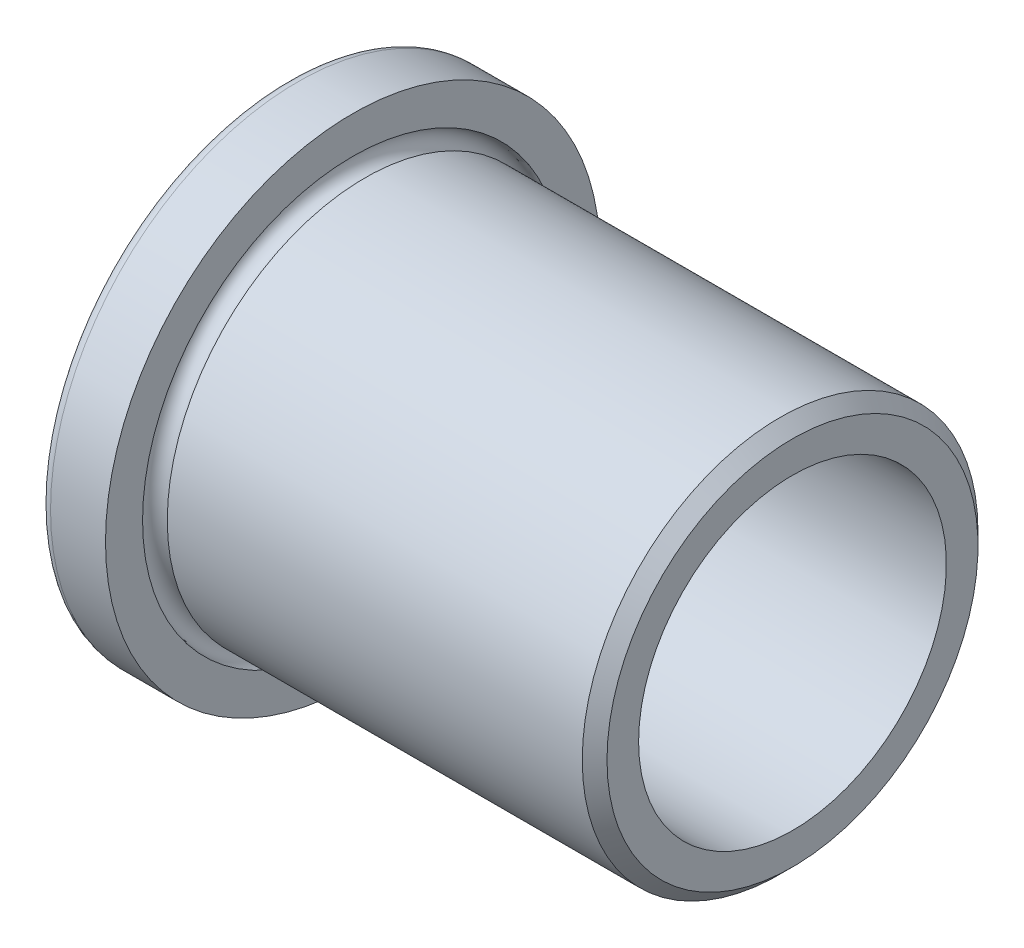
from build123d import *


with BuildPart() as part:
    # Sketch1 → BaseBody (revolve)
    with BuildSketch(Plane.XY, mode=Mode.PRIVATE) as basebody_sk:
        with BuildLine():
            Line((0, 25.4), (0, 34.1249))
            ThreePointArc((0, 34.1249), (0.464967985, 35.247432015), (1.5875, 35.7124))
            Line((1.5875, 35.7124), (9.525, 35.7124))
            Line((9.525, 35.7124), (9.525, 30.35935))
            ThreePointArc((9.525, 30.35935), (8.263274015, 27.313274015), (11.30935, 28.575))
            Line((11.30935, 28.575), (71.2390625, 28.575))
            Line((71.2390625, 28.575), (73.025, 26.7890625))
            Line((73.025, 26.7890625), (73.025, 22.225))
            Line((73.025, 22.225), (3.175, 22.225))
            ThreePointArc((3.175, 22.225), (0.92993597, 23.15493597), (0, 25.4))
        make_face()
    revolve(basebody_sk.sketch.rotate(Axis((0, 0, 0), (1, 0, 0)), 90), axis=Axis((0, 0, 0), (1, 0, 0)))


solid = part.part
